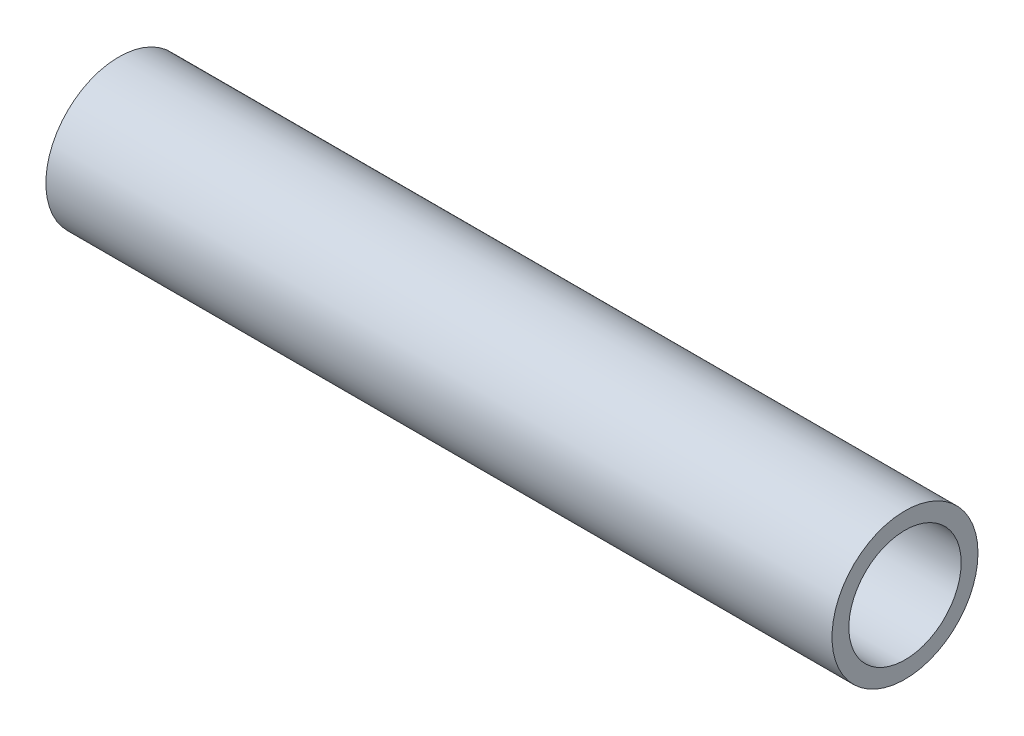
ISO-10303-21;
HEADER;
FILE_DESCRIPTION(('STEP AP214'),'2;1');
FILE_NAME('part.step','',(''),(''),'','','');
FILE_SCHEMA(('AUTOMOTIVE_DESIGN { 1 0 10303 214 1 1 1 1 }'));
ENDSEC;
DATA;
#1=APPLICATION_CONTEXT('core data for automotive mechanical design processes');
#2=APPLICATION_PROTOCOL_DEFINITION('international standard','automotive_design',2000,#1);
#3=PRODUCT_CONTEXT('',#1,'mechanical');
#4=PRODUCT('Part','Part','',(#3));
#5=PRODUCT_RELATED_PRODUCT_CATEGORY('part','',(#4));
#6=PRODUCT_DEFINITION_FORMATION('','',#4);
#7=PRODUCT_DEFINITION_CONTEXT('part definition',#1,'design');
#8=PRODUCT_DEFINITION('design','',#6,#7);
#9=PRODUCT_DEFINITION_SHAPE('','',#8);
#10=(LENGTH_UNIT() NAMED_UNIT(*) SI_UNIT(.MILLI.,.METRE.));
#11=(NAMED_UNIT(*) PLANE_ANGLE_UNIT() SI_UNIT($,.RADIAN.));
#12=(NAMED_UNIT(*) SI_UNIT($,.STERADIAN.) SOLID_ANGLE_UNIT());
#13=UNCERTAINTY_MEASURE_WITH_UNIT(LENGTH_MEASURE(1.E-05),#10,'distance_accuracy_value','');
#14=(GEOMETRIC_REPRESENTATION_CONTEXT(3) GLOBAL_UNCERTAINTY_ASSIGNED_CONTEXT((#13)) GLOBAL_UNIT_ASSIGNED_CONTEXT((#10,
#11,#12)) REPRESENTATION_CONTEXT('',''));
#15=CARTESIAN_POINT('',(0.,0.,0.));
#16=DIRECTION('',(0.,0.,1.));
#17=DIRECTION('',(1.,0.,0.));
#18=AXIS2_PLACEMENT_3D('',#15,#16,#17);
#19=CARTESIAN_POINT('',(177.8,0.,0.));
#20=DIRECTION('',(-1.,0.,0.));
#21=DIRECTION('',(0.,0.,1.));
#22=AXIS2_PLACEMENT_3D('',#19,#20,#21);
#23=CYLINDRICAL_SURFACE('',#22,12.7);
#24=CARTESIAN_POINT('',(177.8,0.,0.));
#25=DIRECTION('',(1.,0.,0.));
#26=DIRECTION('',(0.,0.,-1.));
#27=AXIS2_PLACEMENT_3D('',#24,#25,#26);
#28=CIRCLE('',#27,12.7);
#29=CARTESIAN_POINT('',(177.8,0.,-12.7));
#30=VERTEX_POINT('',#29);
#31=EDGE_CURVE('E53',#30,#30,#28,.T.);
#32=ORIENTED_EDGE('',*,*,#31,.T.);
#33=EDGE_LOOP('',(#32));
#34=FACE_BOUND('',#33,.T.);
#35=CARTESIAN_POINT('',(0.,0.,0.));
#36=DIRECTION('',(1.,0.,0.));
#37=DIRECTION('',(0.,0.,-1.));
#38=AXIS2_PLACEMENT_3D('',#35,#36,#37);
#39=CIRCLE('',#38,12.7);
#40=CARTESIAN_POINT('',(0.,0.,-12.7));
#41=VERTEX_POINT('',#40);
#42=EDGE_CURVE('E60',#41,#41,#39,.T.);
#43=ORIENTED_EDGE('',*,*,#42,.F.);
#44=EDGE_LOOP('',(#43));
#45=FACE_BOUND('',#44,.T.);
#46=ADVANCED_FACE('F45',(#34,#45),#23,.F.);
#47=CARTESIAN_POINT('',(177.8,0.,0.));
#48=DIRECTION('',(-1.,0.,0.));
#49=DIRECTION('',(0.,0.,1.));
#50=AXIS2_PLACEMENT_3D('',#47,#48,#49);
#51=CYLINDRICAL_SURFACE('',#50,16.51);
#52=CARTESIAN_POINT('',(177.8,0.,0.));
#53=DIRECTION('',(1.,0.,0.));
#54=DIRECTION('',(0.,0.,-1.));
#55=AXIS2_PLACEMENT_3D('',#52,#53,#54);
#56=CIRCLE('',#55,16.51);
#57=CARTESIAN_POINT('',(177.8,0.,-16.51));
#58=VERTEX_POINT('',#57);
#59=EDGE_CURVE('E10',#58,#58,#56,.T.);
#60=ORIENTED_EDGE('',*,*,#59,.F.);
#61=EDGE_LOOP('',(#60));
#62=FACE_BOUND('',#61,.T.);
#63=CARTESIAN_POINT('',(0.,0.,0.));
#64=DIRECTION('',(1.,0.,0.));
#65=DIRECTION('',(0.,0.,-1.));
#66=AXIS2_PLACEMENT_3D('',#63,#64,#65);
#67=CIRCLE('',#66,16.51);
#68=CARTESIAN_POINT('',(0.,0.,-16.51));
#69=VERTEX_POINT('',#68);
#70=EDGE_CURVE('E48',#69,#69,#67,.T.);
#71=ORIENTED_EDGE('',*,*,#70,.T.);
#72=EDGE_LOOP('',(#71));
#73=FACE_BOUND('',#72,.T.);
#74=ADVANCED_FACE('F69',(#62,#73),#51,.T.);
#75=CARTESIAN_POINT('',(177.8,0.,0.));
#76=DIRECTION('',(1.,0.,0.));
#77=DIRECTION('',(0.,0.,-1.));
#78=AXIS2_PLACEMENT_3D('',#75,#76,#77);
#79=PLANE('',#78);
#80=ORIENTED_EDGE('',*,*,#31,.F.);
#81=EDGE_LOOP('',(#80));
#82=FACE_BOUND('',#81,.T.);
#83=ORIENTED_EDGE('',*,*,#59,.T.);
#84=EDGE_LOOP('',(#83));
#85=FACE_BOUND('',#84,.T.);
#86=ADVANCED_FACE('F73',(#82,#85),#79,.T.);
#87=CARTESIAN_POINT('',(0.,0.,0.));
#88=DIRECTION('',(1.,0.,0.));
#89=DIRECTION('',(0.,0.,-1.));
#90=AXIS2_PLACEMENT_3D('',#87,#88,#89);
#91=PLANE('',#90);
#92=ORIENTED_EDGE('',*,*,#42,.T.);
#93=EDGE_LOOP('',(#92));
#94=FACE_BOUND('',#93,.T.);
#95=ORIENTED_EDGE('',*,*,#70,.F.);
#96=EDGE_LOOP('',(#95));
#97=FACE_BOUND('',#96,.T.);
#98=ADVANCED_FACE('F71',(#94,#97),#91,.F.);
#99=CLOSED_SHELL('',(#46,#74,#86,#98));
#100=MANIFOLD_SOLID_BREP('B2',#99);
#101=ADVANCED_BREP_SHAPE_REPRESENTATION('',(#18,#100),#14);
#102=SHAPE_DEFINITION_REPRESENTATION(#9,#101);
ENDSEC;
END-ISO-10303-21;
